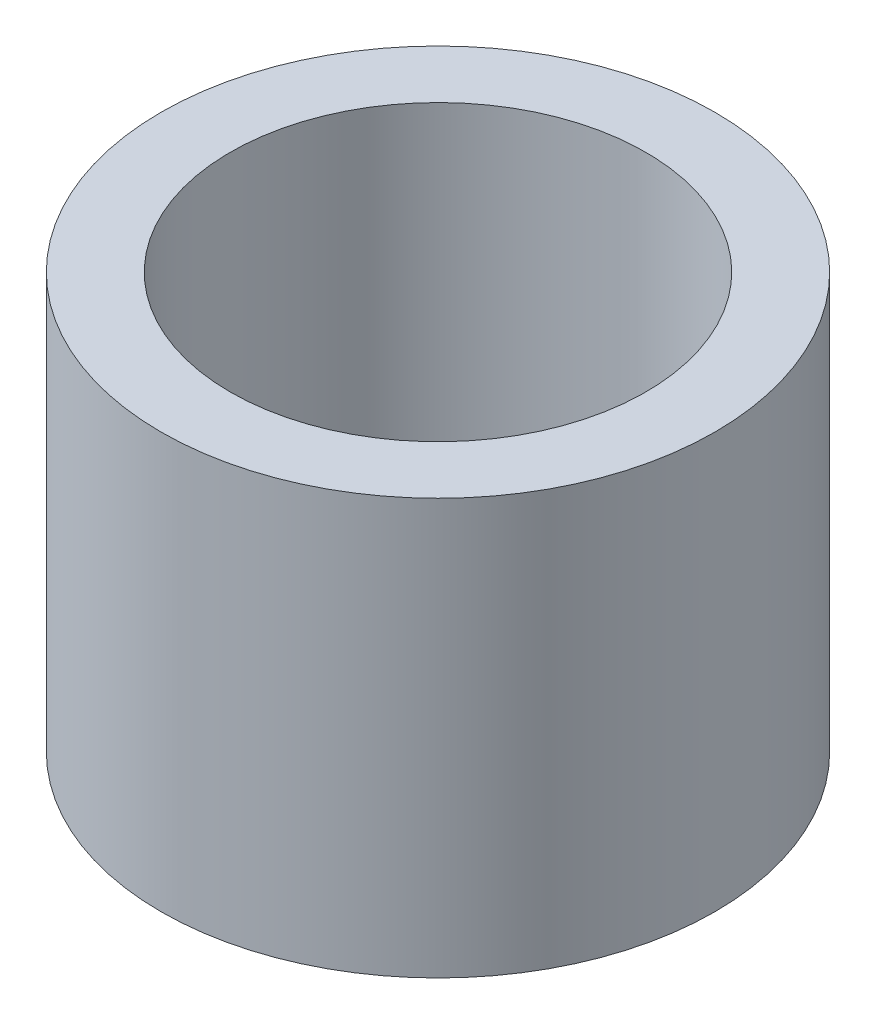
from build123d import *

# Parameters (mm, degrees)
SKETCH1_R           = 2
SKETCH1_R_2         = 1.5
BOSS_EXTRUDE1_DEPTH = 3


with BuildPart() as part:
    # Sketch1 → Boss-Extrude1 (new body)
    with BuildSketch(Plane(origin=(0, 0, 0), x_dir=(1, 0, 0), z_dir=(0, 1, 0))):
        with Locations(Location((0, 0, 0), (0, 0, 270))):
            Circle(SKETCH1_R)
        with Locations(Location((0, 0, 0), (0, 0, 270))):
            Circle(SKETCH1_R_2, mode=Mode.SUBTRACT)
    extrude(amount=BOSS_EXTRUDE1_DEPTH)


solid = part.part
